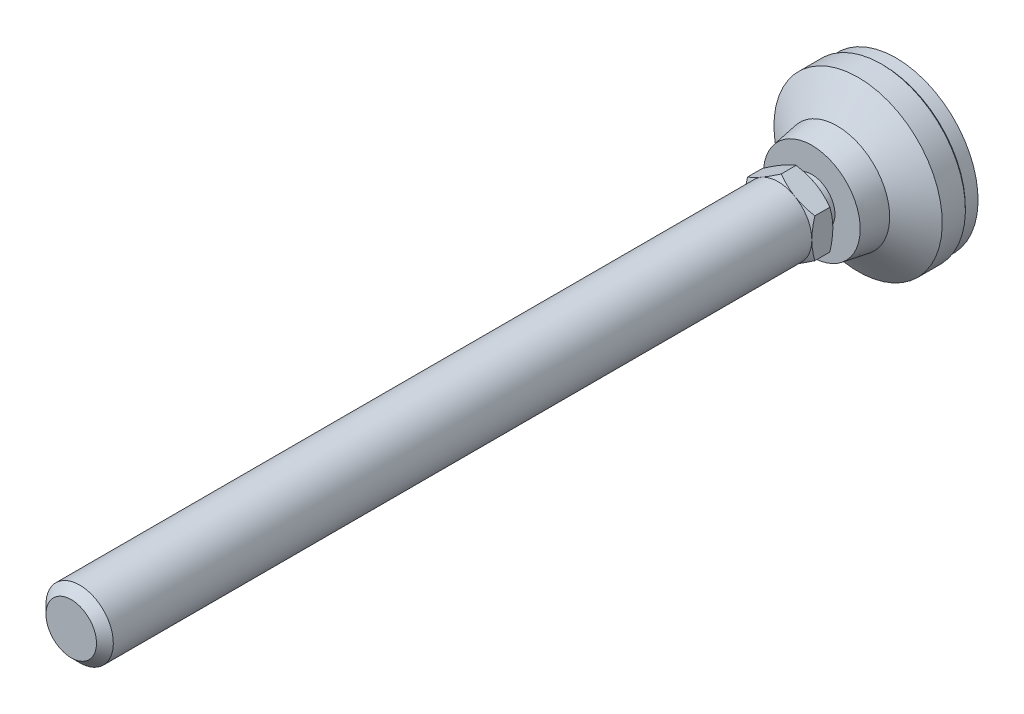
ISO-10303-21;
HEADER;
FILE_DESCRIPTION(('STEP AP214'),'2;1');
FILE_NAME('part.step','',(''),(''),'','','');
FILE_SCHEMA(('AUTOMOTIVE_DESIGN { 1 0 10303 214 1 1 1 1 }'));
ENDSEC;
DATA;
#1=APPLICATION_CONTEXT('core data for automotive mechanical design processes');
#2=APPLICATION_PROTOCOL_DEFINITION('international standard','automotive_design',2000,#1);
#3=PRODUCT_CONTEXT('',#1,'mechanical');
#4=PRODUCT('Part','Part','',(#3));
#5=PRODUCT_RELATED_PRODUCT_CATEGORY('part','',(#4));
#6=PRODUCT_DEFINITION_FORMATION('','',#4);
#7=PRODUCT_DEFINITION_CONTEXT('part definition',#1,'design');
#8=PRODUCT_DEFINITION('design','',#6,#7);
#9=PRODUCT_DEFINITION_SHAPE('','',#8);
#10=(LENGTH_UNIT() NAMED_UNIT(*) SI_UNIT(.MILLI.,.METRE.));
#11=(NAMED_UNIT(*) PLANE_ANGLE_UNIT() SI_UNIT($,.RADIAN.));
#12=(NAMED_UNIT(*) SI_UNIT($,.STERADIAN.) SOLID_ANGLE_UNIT());
#13=UNCERTAINTY_MEASURE_WITH_UNIT(LENGTH_MEASURE(1.E-05),#10,'distance_accuracy_value','');
#14=(GEOMETRIC_REPRESENTATION_CONTEXT(3) GLOBAL_UNCERTAINTY_ASSIGNED_CONTEXT((#13)) GLOBAL_UNIT_ASSIGNED_CONTEXT((#10,
#11,#12)) REPRESENTATION_CONTEXT('',''));
#15=CARTESIAN_POINT('',(0.,0.,0.));
#16=DIRECTION('',(0.,0.,1.));
#17=DIRECTION('',(1.,0.,0.));
#18=AXIS2_PLACEMENT_3D('',#15,#16,#17);
#19=CARTESIAN_POINT('',(0.,0.,2.));
#20=DIRECTION('',(0.,0.,-1.));
#21=DIRECTION('',(0.,1.,0.));
#22=AXIS2_PLACEMENT_3D('',#19,#20,#21);
#23=CYLINDRICAL_SURFACE('',#22,20.);
#24=CARTESIAN_POINT('',(0.,0.,3.5));
#25=DIRECTION('',(0.,0.,-1.));
#26=DIRECTION('',(0.,1.,0.));
#27=AXIS2_PLACEMENT_3D('',#24,#25,#26);
#28=CIRCLE('',#27,20.);
#29=CARTESIAN_POINT('',(0.,20.,3.5));
#30=VERTEX_POINT('',#29);
#31=EDGE_CURVE('E163',#30,#30,#28,.F.);
#32=ORIENTED_EDGE('',*,*,#31,.T.);
#33=EDGE_LOOP('',(#32));
#34=FACE_BOUND('',#33,.T.);
#35=CARTESIAN_POINT('',(0.,0.,9.));
#36=DIRECTION('',(0.,0.,-1.));
#37=DIRECTION('',(0.,1.,0.));
#38=AXIS2_PLACEMENT_3D('',#35,#36,#37);
#39=CIRCLE('',#38,20.);
#40=CARTESIAN_POINT('',(0.,20.,9.));
#41=VERTEX_POINT('',#40);
#42=EDGE_CURVE('E143',#41,#41,#39,.T.);
#43=ORIENTED_EDGE('',*,*,#42,.T.);
#44=EDGE_LOOP('',(#43));
#45=FACE_BOUND('',#44,.T.);
#46=ADVANCED_FACE('F14',(#34,#45),#23,.T.);
#47=CARTESIAN_POINT('',(0.,0.,2.));
#48=DIRECTION('',(0.,0.,-1.));
#49=DIRECTION('',(0.,1.,0.));
#50=AXIS2_PLACEMENT_3D('',#47,#48,#49);
#51=CYLINDRICAL_SURFACE('',#50,5.50000000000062);
#52=CARTESIAN_POINT('',(0.,0.,20.));
#53=DIRECTION('',(0.,0.,-1.));
#54=DIRECTION('',(0.,1.,0.));
#55=AXIS2_PLACEMENT_3D('',#52,#53,#54);
#56=CIRCLE('',#55,5.50000000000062);
#57=CARTESIAN_POINT('',(0.,5.50000000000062,20.));
#58=VERTEX_POINT('',#57);
#59=EDGE_CURVE('E153',#58,#58,#56,.T.);
#60=ORIENTED_EDGE('',*,*,#59,.F.);
#61=EDGE_LOOP('',(#60));
#62=FACE_BOUND('',#61,.T.);
#63=CARTESIAN_POINT('',(0.,0.,22.9999999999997));
#64=DIRECTION('',(0.,0.,-1.));
#65=DIRECTION('',(0.,1.,0.));
#66=AXIS2_PLACEMENT_3D('',#63,#64,#65);
#67=CIRCLE('',#66,5.50000000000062);
#68=CARTESIAN_POINT('',(0.,5.50000000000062,22.9999999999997));
#69=VERTEX_POINT('',#68);
#70=EDGE_CURVE('E134',#69,#69,#67,.T.);
#71=ORIENTED_EDGE('',*,*,#70,.T.);
#72=EDGE_LOOP('',(#71));
#73=FACE_BOUND('',#72,.T.);
#74=ADVANCED_FACE('F293',(#62,#73),#51,.T.);
#75=CARTESIAN_POINT('',(-11.5,0.,20.));
#76=DIRECTION('',(0.,0.,-1.));
#77=DIRECTION('',(0.,1.,0.));
#78=AXIS2_PLACEMENT_3D('',#75,#76,#77);
#79=PLANE('',#78);
#80=CARTESIAN_POINT('',(0.,0.,20.));
#81=DIRECTION('',(0.,0.,-1.));
#82=DIRECTION('',(0.,1.,0.));
#83=AXIS2_PLACEMENT_3D('',#80,#81,#82);
#84=CIRCLE('',#83,11.5);
#85=CARTESIAN_POINT('',(0.,11.5,20.));
#86=VERTEX_POINT('',#85);
#87=EDGE_CURVE('E150',#86,#86,#84,.T.);
#88=ORIENTED_EDGE('',*,*,#87,.F.);
#89=EDGE_LOOP('',(#88));
#90=FACE_BOUND('',#89,.T.);
#91=ORIENTED_EDGE('',*,*,#59,.T.);
#92=EDGE_LOOP('',(#91));
#93=FACE_BOUND('',#92,.T.);
#94=ADVANCED_FACE('F299',(#90,#93),#79,.F.);
#95=CARTESIAN_POINT('',(0.,0.,20.));
#96=DIRECTION('',(0.,0.,-1.));
#97=DIRECTION('',(0.,1.,0.));
#98=AXIS2_PLACEMENT_3D('',#95,#96,#97);
#99=CONICAL_SURFACE('',#98,11.5,0.165148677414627);
#100=CARTESIAN_POINT('',(0.,0.,14.));
#101=DIRECTION('',(0.,0.,-1.));
#102=DIRECTION('',(0.,1.,0.));
#103=AXIS2_PLACEMENT_3D('',#100,#101,#102);
#104=CIRCLE('',#103,12.5);
#105=CARTESIAN_POINT('',(0.,12.5,14.));
#106=VERTEX_POINT('',#105);
#107=EDGE_CURVE('E146',#106,#106,#104,.T.);
#108=ORIENTED_EDGE('',*,*,#107,.F.);
#109=EDGE_LOOP('',(#108));
#110=FACE_BOUND('',#109,.T.);
#111=ORIENTED_EDGE('',*,*,#87,.T.);
#112=EDGE_LOOP('',(#111));
#113=FACE_BOUND('',#112,.T.);
#114=ADVANCED_FACE('F308',(#110,#113),#99,.T.);
#115=CARTESIAN_POINT('',(0.,0.,14.));
#116=DIRECTION('',(0.,0.,-1.));
#117=DIRECTION('',(0.,1.,0.));
#118=AXIS2_PLACEMENT_3D('',#115,#116,#117);
#119=CONICAL_SURFACE('',#118,12.5,0.982793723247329);
#120=ORIENTED_EDGE('',*,*,#42,.F.);
#121=EDGE_LOOP('',(#120));
#122=FACE_BOUND('',#121,.T.);
#123=ORIENTED_EDGE('',*,*,#107,.T.);
#124=EDGE_LOOP('',(#123));
#125=FACE_BOUND('',#124,.T.);
#126=ADVANCED_FACE('F304',(#122,#125),#119,.T.);
#127=CARTESIAN_POINT('',(0.,-5.50000000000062,22.9999999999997));
#128=DIRECTION('',(0.,0.,-1.));
#129=DIRECTION('',(0.,1.,0.));
#130=AXIS2_PLACEMENT_3D('',#127,#128,#129);
#131=PLANE('',#130);
#132=CARTESIAN_POINT('',(0.,0.,22.9999999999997));
#133=DIRECTION('',(0.,0.,1.));
#134=DIRECTION('',(0.,-1.,0.));
#135=AXIS2_PLACEMENT_3D('',#132,#133,#134);
#136=CIRCLE('',#135,8.00000000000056);
#137=CARTESIAN_POINT('',(-4.,6.92820323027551,22.9999999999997));
#138=VERTEX_POINT('',#137);
#139=CARTESIAN_POINT('',(-8.,0.,22.9999999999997));
#140=VERTEX_POINT('',#139);
#141=EDGE_CURVE('E374',#138,#140,#136,.T.);
#142=ORIENTED_EDGE('',*,*,#141,.F.);
#143=CARTESIAN_POINT('',(4.,6.92820323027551,22.9999999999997));
#144=VERTEX_POINT('',#143);
#145=EDGE_CURVE('E115',#144,#138,#136,.T.);
#146=ORIENTED_EDGE('',*,*,#145,.F.);
#147=CARTESIAN_POINT('',(8.,0.,22.9999999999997));
#148=VERTEX_POINT('',#147);
#149=EDGE_CURVE('E375',#148,#144,#136,.T.);
#150=ORIENTED_EDGE('',*,*,#149,.F.);
#151=CARTESIAN_POINT('',(4.,-6.92820323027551,22.9999999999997));
#152=VERTEX_POINT('',#151);
#153=EDGE_CURVE('E35',#152,#148,#136,.T.);
#154=ORIENTED_EDGE('',*,*,#153,.F.);
#155=CARTESIAN_POINT('',(-4.,-6.92820323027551,22.9999999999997));
#156=VERTEX_POINT('',#155);
#157=EDGE_CURVE('E43',#156,#152,#136,.T.);
#158=ORIENTED_EDGE('',*,*,#157,.F.);
#159=EDGE_CURVE('E367',#140,#156,#136,.T.);
#160=ORIENTED_EDGE('',*,*,#159,.F.);
#161=EDGE_LOOP('',(#142,#146,#150,#154,#158,#160));
#162=FACE_BOUND('',#161,.T.);
#163=ORIENTED_EDGE('',*,*,#70,.F.);
#164=EDGE_LOOP('',(#163));
#165=FACE_BOUND('',#164,.T.);
#166=ADVANCED_FACE('F307',(#162,#165),#131,.T.);
#167=CARTESIAN_POINT('',(0.,0.,3.));
#168=DIRECTION('',(0.,0.,1.));
#169=DIRECTION('',(0.,-1.,0.));
#170=AXIS2_PLACEMENT_3D('',#167,#168,#169);
#171=CONICAL_SURFACE('',#170,19.5,0.785398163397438);
#172=ORIENTED_EDGE('',*,*,#31,.F.);
#173=EDGE_LOOP('',(#172));
#174=FACE_BOUND('',#173,.T.);
#175=CARTESIAN_POINT('',(0.,0.,3.));
#176=DIRECTION('',(0.,0.,-1.));
#177=DIRECTION('',(0.,1.,0.));
#178=AXIS2_PLACEMENT_3D('',#175,#176,#177);
#179=CIRCLE('',#178,19.5);
#180=CARTESIAN_POINT('',(0.,19.5,3.));
#181=VERTEX_POINT('',#180);
#182=EDGE_CURVE('E160',#181,#181,#179,.T.);
#183=ORIENTED_EDGE('',*,*,#182,.F.);
#184=EDGE_LOOP('',(#183));
#185=FACE_BOUND('',#184,.T.);
#186=ADVANCED_FACE('F16',(#174,#185),#171,.T.);
#187=CARTESIAN_POINT('',(0.,0.,0.));
#188=DIRECTION('',(0.,0.,1.));
#189=DIRECTION('',(0.,-1.,0.));
#190=AXIS2_PLACEMENT_3D('',#187,#188,#189);
#191=CYLINDRICAL_SURFACE('',#190,19.5);
#192=CARTESIAN_POINT('',(0.,0.,0.));
#193=DIRECTION('',(0.,0.,-1.));
#194=DIRECTION('',(0.,1.,0.));
#195=AXIS2_PLACEMENT_3D('',#192,#193,#194);
#196=CIRCLE('',#195,19.5);
#197=CARTESIAN_POINT('',(0.,19.5,0.));
#198=VERTEX_POINT('',#197);
#199=EDGE_CURVE('E406',#198,#198,#196,.T.);
#200=ORIENTED_EDGE('',*,*,#199,.F.);
#201=EDGE_LOOP('',(#200));
#202=FACE_BOUND('',#201,.T.);
#203=ORIENTED_EDGE('',*,*,#182,.T.);
#204=EDGE_LOOP('',(#203));
#205=FACE_BOUND('',#204,.T.);
#206=ADVANCED_FACE('F335',(#202,#205),#191,.T.);
#207=CARTESIAN_POINT('',(0.,0.,0.));
#208=DIRECTION('',(0.,0.,-1.));
#209=DIRECTION('',(0.,1.,0.));
#210=AXIS2_PLACEMENT_3D('',#207,#208,#209);
#211=PLANE('',#210);
#212=ORIENTED_EDGE('',*,*,#199,.T.);
#213=EDGE_LOOP('',(#212));
#214=FACE_BOUND('',#213,.T.);
#215=ADVANCED_FACE('F183',(#214),#211,.T.);
#216=CARTESIAN_POINT('',(0.,0.,22.9999999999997));
#217=DIRECTION('',(0.,0.,1.));
#218=DIRECTION('',(0.,-1.,0.));
#219=AXIS2_PLACEMENT_3D('',#216,#217,#218);
#220=CONICAL_SURFACE('',#219,8.00000000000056,1.0471975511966);
#221=CARTESIAN_POINT('',(-0.000199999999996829,9.23771977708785,23.7145978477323));
#222=CARTESIAN_POINT('',(0.1756487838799,9.13619343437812,23.6559907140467));
#223=CARTESIAN_POINT('',(0.352153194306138,9.03428856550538,23.6000434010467));
#224=CARTESIAN_POINT('',(0.706595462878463,8.82965122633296,23.494201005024));
#225=CARTESIAN_POINT('',(0.884533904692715,8.72691841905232,23.4443085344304));
#226=CARTESIAN_POINT('',(1.42119823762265,8.41707512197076,23.3046927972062));
#227=CARTESIAN_POINT('',(1.78204258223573,8.20874154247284,23.2252811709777));
#228=CARTESIAN_POINT('',(2.32203917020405,7.89697436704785,23.1321616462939));
#229=CARTESIAN_POINT('',(2.49957818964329,7.79447216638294,23.1056345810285));
#230=CARTESIAN_POINT('',(2.8554591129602,7.58900421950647,23.0611531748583));
#231=CARTESIAN_POINT('',(3.03380094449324,7.4860385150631,23.043198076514));
#232=CARTESIAN_POINT('',(3.3907916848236,7.27992981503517,23.0163156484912));
#233=CARTESIAN_POINT('',(3.5694400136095,7.17678715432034,23.0073780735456));
#234=CARTESIAN_POINT('',(3.92690170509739,6.97040655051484,22.9987223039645));
#235=CARTESIAN_POINT('',(4.10571506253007,6.86716861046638,22.9990038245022));
#236=CARTESIAN_POINT('',(4.44001336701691,6.67416139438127,23.0081450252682));
#237=CARTESIAN_POINT('',(4.59552190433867,6.58437849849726,23.0158896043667));
#238=CARTESIAN_POINT('',(4.90617476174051,6.40502298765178,23.0382011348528));
#239=CARTESIAN_POINT('',(5.06131905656,6.31545038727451,23.0527685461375));
#240=CARTESIAN_POINT('',(5.52615131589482,6.04707935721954,23.1063606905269));
#241=CARTESIAN_POINT('',(5.83501648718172,5.86875596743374,23.1552686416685));
#242=CARTESIAN_POINT('',(6.4560232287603,5.51021755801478,23.2775394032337));
#243=CARTESIAN_POINT('',(6.76808554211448,5.3300482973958,23.3514205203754));
#244=CARTESIAN_POINT('',(7.38755648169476,4.97239658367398,23.5191001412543));
#245=CARTESIAN_POINT('',(7.69497304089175,4.79490955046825,23.6128592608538));
#246=CARTESIAN_POINT('',(8.0002,4.61868668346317,23.7145978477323));
#247=B_SPLINE_CURVE_WITH_KNOTS('',3,(#221,#222,#223,#224,#225,#226,#227,#228,#229,#230,#231,
#232,#233,#234,#235,#236,#237,#238,#239,#240,#241,#242,#243,#244,#245,#246),.UNSPECIFIED.,.F.,
.F.,(4,2,2,2,2,2,2,2,2,2,2,2,4),(0.,0.63397354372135,1.26821965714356,2.53934712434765,
3.15934343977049,3.77928496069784,4.39852133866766,5.01773858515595,5.55680239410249,
6.09590254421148,7.17487077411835,8.27776850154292,9.37850115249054),.UNSPECIFIED.);
#248=CARTESIAN_POINT('',(0.,9.23760430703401,23.7145311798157));
#249=VERTEX_POINT('',#248);
#250=EDGE_CURVE('E112',#249,#144,#247,.T.);
#251=ORIENTED_EDGE('',*,*,#250,.T.);
#252=ORIENTED_EDGE('',*,*,#145,.T.);
#253=CARTESIAN_POINT('',(-8.0002,4.61868668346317,23.7145978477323));
#254=CARTESIAN_POINT('',(-7.8243512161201,4.7202130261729,23.6559907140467));
#255=CARTESIAN_POINT('',(-7.64784680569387,4.82211789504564,23.6000434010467));
#256=CARTESIAN_POINT('',(-7.29340453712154,5.02675523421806,23.494201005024));
#257=CARTESIAN_POINT('',(-7.11546609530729,5.1294880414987,23.4443085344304));
#258=CARTESIAN_POINT('',(-6.57880176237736,5.43933133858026,23.3046927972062));
#259=CARTESIAN_POINT('',(-6.21795741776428,5.64766491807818,23.2252811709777));
#260=CARTESIAN_POINT('',(-5.67796082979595,5.95943209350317,23.1321616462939));
#261=CARTESIAN_POINT('',(-5.50042181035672,6.06193429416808,23.1056345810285));
#262=CARTESIAN_POINT('',(-5.1445408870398,6.26740224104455,23.0611531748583));
#263=CARTESIAN_POINT('',(-4.96619905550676,6.37036794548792,23.043198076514));
#264=CARTESIAN_POINT('',(-4.60920831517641,6.57647664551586,23.0163156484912));
#265=CARTESIAN_POINT('',(-4.4305599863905,6.67961930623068,23.0073780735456));
#266=CARTESIAN_POINT('',(-4.07309829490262,6.88599991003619,22.9987223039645));
#267=CARTESIAN_POINT('',(-3.89428493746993,6.98923785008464,22.9990038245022));
#268=CARTESIAN_POINT('',(-3.55998663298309,7.18224506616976,23.0081450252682));
#269=CARTESIAN_POINT('',(-3.40447809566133,7.27202796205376,23.0158896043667));
#270=CARTESIAN_POINT('',(-3.09382523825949,7.45138347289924,23.0382011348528));
#271=CARTESIAN_POINT('',(-2.93868094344,7.54095607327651,23.0527685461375));
#272=CARTESIAN_POINT('',(-2.47384868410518,7.80932710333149,23.1063606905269));
#273=CARTESIAN_POINT('',(-2.16498351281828,7.98765049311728,23.1552686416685));
#274=CARTESIAN_POINT('',(-1.5439767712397,8.34618890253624,23.2775394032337));
#275=CARTESIAN_POINT('',(-1.23191445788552,8.52635816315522,23.3514205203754));
#276=CARTESIAN_POINT('',(-0.612443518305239,8.88400987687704,23.5191001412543));
#277=CARTESIAN_POINT('',(-0.305026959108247,9.06149691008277,23.6128592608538));
#278=CARTESIAN_POINT('',(0.000200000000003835,9.23771977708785,23.7145978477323));
#279=B_SPLINE_CURVE_WITH_KNOTS('',3,(#253,#254,#255,#256,#257,#258,#259,#260,#261,#262,#263,
#264,#265,#266,#267,#268,#269,#270,#271,#272,#273,#274,#275,#276,#277,#278),.UNSPECIFIED.,.F.,
.F.,(4,2,2,2,2,2,2,2,2,2,2,2,4),(0.,0.63397354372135,1.26821965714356,2.53934712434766,
3.15934343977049,3.77928496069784,4.39852133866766,5.01773858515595,5.55680239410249,
6.09590254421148,7.17487077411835,8.27776850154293,9.37850115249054),.UNSPECIFIED.);
#280=EDGE_CURVE('E18',#138,#249,#279,.T.);
#281=ORIENTED_EDGE('',*,*,#280,.T.);
#282=EDGE_LOOP('',(#251,#252,#281));
#283=FACE_BOUND('',#282,.T.);
#284=ADVANCED_FACE('F111',(#283),#220,.T.);
#285=CARTESIAN_POINT('',(-8.,12.3990254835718,26.9005059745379));
#286=CARTESIAN_POINT('',(-8.,12.049683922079,26.7310747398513));
#287=CARTESIAN_POINT('',(-8.,11.6995396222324,26.5632702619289));
#288=CARTESIAN_POINT('',(-8.,10.9972186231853,26.2318298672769));
#289=CARTESIAN_POINT('',(-8.,10.6450416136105,26.0681946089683));
#290=CARTESIAN_POINT('',(-8.,9.93641002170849,25.7451827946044));
#291=CARTESIAN_POINT('',(-8.,9.5799425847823,25.5858343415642));
#292=CARTESIAN_POINT('',(-8.,8.86416996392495,25.2736684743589));
#293=CARTESIAN_POINT('',(-8.,8.50486491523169,25.1208507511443));
#294=CARTESIAN_POINT('',(-8.,7.77126229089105,24.8187000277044));
#295=CARTESIAN_POINT('',(-8.,7.39685337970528,24.669635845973));
#296=CARTESIAN_POINT('',(-8.,6.64365326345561,24.3828076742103));
#297=CARTESIAN_POINT('',(-8.,6.26486157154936,24.2450449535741));
#298=CARTESIAN_POINT('',(-8.,5.50300019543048,23.9844423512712));
#299=CARTESIAN_POINT('',(-8.,5.11994098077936,23.8615721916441));
#300=CARTESIAN_POINT('',(-8.,4.34834145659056,23.6347009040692));
#301=CARTESIAN_POINT('',(-8.,3.95980291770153,23.5306938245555));
#302=CARTESIAN_POINT('',(-8.,3.17912277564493,23.3471068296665));
#303=CARTESIAN_POINT('',(-8.,2.7870132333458,23.2673942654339));
#304=CARTESIAN_POINT('',(-8.,2.19528425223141,23.1694992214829));
#305=CARTESIAN_POINT('',(-8.,1.99743252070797,23.1404785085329));
#306=CARTESIAN_POINT('',(-8.,1.60074822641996,23.0902310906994));
#307=CARTESIAN_POINT('',(-8.,1.40191576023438,23.0690036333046));
#308=CARTESIAN_POINT('',(-8.,1.00613017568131,23.0350314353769));
#309=CARTESIAN_POINT('',(-8.,0.809186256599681,23.0221799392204));
#310=CARTESIAN_POINT('',(-8.,0.414931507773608,23.0048162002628));
#311=CARTESIAN_POINT('',(-8.,0.217620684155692,23.0003038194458));
#312=CARTESIAN_POINT('',(-8.,-0.177015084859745,22.9997259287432));
#313=CARTESIAN_POINT('',(-8.,-0.374340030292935,23.0036604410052));
#314=CARTESIAN_POINT('',(-8.,-0.768648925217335,23.0198803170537));
#315=CARTESIAN_POINT('',(-8.,-0.965632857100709,23.0321660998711));
#316=CARTESIAN_POINT('',(-8.,-1.43928823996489,23.0714887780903));
#317=CARTESIAN_POINT('',(-8.,-1.71563654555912,23.1025015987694));
#318=CARTESIAN_POINT('',(-8.,-2.26626398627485,23.1792696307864));
#319=CARTESIAN_POINT('',(-8.,-2.54054283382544,23.2250268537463));
#320=CARTESIAN_POINT('',(-8.,-3.35997272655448,23.3819872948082));
#321=CARTESIAN_POINT('',(-8.,-3.90140681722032,23.512850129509));
#322=CARTESIAN_POINT('',(-8.,-4.71095852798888,23.7395480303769));
#323=CARTESIAN_POINT('',(-8.,-4.98328146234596,23.8212275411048));
#324=CARTESIAN_POINT('',(-8.,-5.52528209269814,23.9930142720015));
#325=CARTESIAN_POINT('',(-8.,-5.79495977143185,24.0831215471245));
#326=CARTESIAN_POINT('',(-8.,-6.33175551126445,24.2703227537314));
#327=CARTESIAN_POINT('',(-8.,-6.59887439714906,24.3674143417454));
#328=CARTESIAN_POINT('',(-8.,-7.13090307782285,24.567447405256));
#329=CARTESIAN_POINT('',(-8.,-7.39581289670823,24.6703888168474));
#330=CARTESIAN_POINT('',(-8.,-8.0135494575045,24.9170369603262));
#331=CARTESIAN_POINT('',(-8.,-8.36559791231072,25.0626891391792));
#332=CARTESIAN_POINT('',(-8.,-9.06675398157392,25.3609277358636));
#333=CARTESIAN_POINT('',(-8.,-9.41586142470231,25.5135145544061));
#334=CARTESIAN_POINT('',(-8.,-10.1116727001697,25.8242552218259));
#335=CARTESIAN_POINT('',(-8.,-10.4583760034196,25.9824102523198));
#336=CARTESIAN_POINT('',(-8.,-11.149698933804,26.3031820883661));
#337=CARTESIAN_POINT('',(-8.,-11.4943186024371,26.4657988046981));
#338=CARTESIAN_POINT('',(-8.,-12.1821776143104,26.7948439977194));
#339=CARTESIAN_POINT('',(-8.,-12.5254151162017,26.9612763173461));
#340=CARTESIAN_POINT('',(-8.,-13.2104170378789,27.2971480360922));
#341=CARTESIAN_POINT('',(-8.,-13.552181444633,27.4665874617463));
#342=CARTESIAN_POINT('',(-8.,-14.5755246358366,27.9785839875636));
#343=CARTESIAN_POINT('',(-8.,-15.2552416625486,28.3248619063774));
#344=CARTESIAN_POINT('',(-8.,-16.5553497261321,28.9956871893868));
#345=CARTESIAN_POINT('',(-8.,-17.1760268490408,29.319682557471));
#346=CARTESIAN_POINT('',(-8.,-18.4150545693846,29.9721389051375));
#347=CARTESIAN_POINT('',(-8.,-19.0334050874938,30.3006000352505));
#348=CARTESIAN_POINT('',(-8.,-20.2667857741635,30.9601289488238));
#349=CARTESIAN_POINT('',(-8.,-20.8818203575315,31.2911884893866));
#350=CARTESIAN_POINT('',(-8.,-22.1103972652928,31.9559875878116));
#351=CARTESIAN_POINT('',(-8.,-22.7239396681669,32.2897270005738));
#352=CARTESIAN_POINT('',(-8.,-23.3369307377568,32.6244691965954));
#353=B_SPLINE_CURVE_WITH_KNOTS('',3,(#285,#286,#287,#288,#289,#290,#291,#292,#293,#294,#295,
#296,#297,#298,#299,#300,#301,#302,#303,#304,#305,#306,#307,#308,#309,#310,#311,#312,#313,#314,
#315,#316,#317,#318,#319,#320,#321,#322,#323,#324,#325,#326,#327,#328,#329,#330,#331,#332,#333,
#334,#335,#336,#337,#338,#339,#340,#341,#342,#343,#344,#345,#346,#347,#348,#349,#350,#351,#352),
.UNSPECIFIED.,.F.,.F.,(4,2,2,2,2,2,2,2,2,2,2,2,2,2,2,2,2,2,2,2,2,2,2,2,2,2,2,2,2,2,2,2,2,4),(0.,
1.16479673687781,2.32977629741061,3.50111130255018,4.67239081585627,5.88122380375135,
7.09019238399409,8.29666025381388,9.50274680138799,10.7021249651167,11.3019019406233,
11.9016209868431,12.4935385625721,13.0854463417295,13.677355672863,14.2692947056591,
15.1030724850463,15.9369640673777,17.6056780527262,18.4585330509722,19.3113936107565,
20.1639693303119,21.0165357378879,22.159403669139,23.3023377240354,24.4455157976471,
25.5886710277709,26.7330331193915,27.8774053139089,30.165855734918,32.2662928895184,
34.3668010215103,36.4622203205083,38.5575269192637),.UNSPECIFIED.);
#354=CARTESIAN_POINT('',(-8.,4.61880215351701,23.7145311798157));
#355=VERTEX_POINT('',#354);
#356=EDGE_CURVE('E347',#140,#355,#353,.F.);
#357=ORIENTED_EDGE('',*,*,#356,.T.);
#358=EDGE_CURVE('E9',#355,#138,#279,.T.);
#359=ORIENTED_EDGE('',*,*,#358,.T.);
#360=ORIENTED_EDGE('',*,*,#141,.T.);
#361=EDGE_LOOP('',(#357,#359,#360));
#362=FACE_BOUND('',#361,.T.);
#363=ADVANCED_FACE('F181',(#362),#220,.T.);
#364=CARTESIAN_POINT('',(0.000200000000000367,-9.23771977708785,23.7145978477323));
#365=CARTESIAN_POINT('',(-0.175648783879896,-9.13619343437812,23.6559907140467));
#366=CARTESIAN_POINT('',(-0.352153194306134,-9.03428856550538,23.6000434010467));
#367=CARTESIAN_POINT('',(-0.70659546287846,-8.82965122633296,23.494201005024));
#368=CARTESIAN_POINT('',(-0.884533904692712,-8.72691841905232,23.4443085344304));
#369=CARTESIAN_POINT('',(-1.42119823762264,-8.41707512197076,23.3046927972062));
#370=CARTESIAN_POINT('',(-1.78204258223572,-8.20874154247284,23.2252811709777));
#371=CARTESIAN_POINT('',(-2.32203917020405,-7.89697436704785,23.1321616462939));
#372=CARTESIAN_POINT('',(-2.49957818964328,-7.79447216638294,23.1056345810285));
#373=CARTESIAN_POINT('',(-2.8554591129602,-7.58900421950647,23.0611531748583));
#374=CARTESIAN_POINT('',(-3.03380094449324,-7.4860385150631,23.043198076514));
#375=CARTESIAN_POINT('',(-3.39079168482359,-7.27992981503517,23.0163156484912));
#376=CARTESIAN_POINT('',(-3.5694400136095,-7.17678715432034,23.0073780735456));
#377=CARTESIAN_POINT('',(-3.92690170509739,-6.97040655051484,22.9987223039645));
#378=CARTESIAN_POINT('',(-4.10571506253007,-6.86716861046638,22.9990038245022));
#379=CARTESIAN_POINT('',(-4.44001336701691,-6.67416139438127,23.0081450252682));
#380=CARTESIAN_POINT('',(-4.59552190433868,-6.58437849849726,23.0158896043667));
#381=CARTESIAN_POINT('',(-4.90617476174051,-6.40502298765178,23.0382011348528));
#382=CARTESIAN_POINT('',(-5.06131905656,-6.31545038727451,23.0527685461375));
#383=CARTESIAN_POINT('',(-5.52615131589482,-6.04707935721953,23.1063606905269));
#384=CARTESIAN_POINT('',(-5.83501648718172,-5.86875596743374,23.1552686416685));
#385=CARTESIAN_POINT('',(-6.4560232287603,-5.51021755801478,23.2775394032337));
#386=CARTESIAN_POINT('',(-6.76808554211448,-5.3300482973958,23.3514205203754));
#387=CARTESIAN_POINT('',(-7.38755648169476,-4.97239658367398,23.5191001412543));
#388=CARTESIAN_POINT('',(-7.69497304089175,-4.79490955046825,23.6128592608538));
#389=CARTESIAN_POINT('',(-8.0002,-4.61868668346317,23.7145978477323));
#390=B_SPLINE_CURVE_WITH_KNOTS('',3,(#364,#365,#366,#367,#368,#369,#370,#371,#372,#373,#374,
#375,#376,#377,#378,#379,#380,#381,#382,#383,#384,#385,#386,#387,#388,#389),.UNSPECIFIED.,.F.,
.F.,(4,2,2,2,2,2,2,2,2,2,2,2,4),(0.,0.63397354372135,1.26821965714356,2.53934712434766,
3.15934343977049,3.77928496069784,4.39852133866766,5.01773858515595,5.55680239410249,
6.09590254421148,7.17487077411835,8.27776850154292,9.37850115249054),.UNSPECIFIED.);
#391=CARTESIAN_POINT('',(-8.,-4.618802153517,23.7145311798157));
#392=VERTEX_POINT('',#391);
#393=EDGE_CURVE('E354',#156,#392,#390,.T.);
#394=ORIENTED_EDGE('',*,*,#393,.T.);
#395=EDGE_CURVE('E353',#392,#140,#353,.F.);
#396=ORIENTED_EDGE('',*,*,#395,.T.);
#397=ORIENTED_EDGE('',*,*,#159,.T.);
#398=EDGE_LOOP('',(#394,#396,#397));
#399=FACE_BOUND('',#398,.T.);
#400=ADVANCED_FACE('F365',(#399),#220,.T.);
#401=CARTESIAN_POINT('',(8.0002,-4.61868668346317,23.7145978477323));
#402=CARTESIAN_POINT('',(7.8243512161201,-4.7202130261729,23.6559907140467));
#403=CARTESIAN_POINT('',(7.64784680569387,-4.82211789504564,23.6000434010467));
#404=CARTESIAN_POINT('',(7.29340453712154,-5.02675523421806,23.494201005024));
#405=CARTESIAN_POINT('',(7.11546609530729,-5.1294880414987,23.4443085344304));
#406=CARTESIAN_POINT('',(6.57880176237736,-5.43933133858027,23.3046927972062));
#407=CARTESIAN_POINT('',(6.21795741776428,-5.64766491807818,23.2252811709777));
#408=CARTESIAN_POINT('',(5.67796082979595,-5.95943209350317,23.1321616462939));
#409=CARTESIAN_POINT('',(5.50042181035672,-6.06193429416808,23.1056345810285));
#410=CARTESIAN_POINT('',(5.1445408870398,-6.26740224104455,23.0611531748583));
#411=CARTESIAN_POINT('',(4.96619905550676,-6.37036794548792,23.043198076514));
#412=CARTESIAN_POINT('',(4.60920831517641,-6.57647664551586,23.0163156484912));
#413=CARTESIAN_POINT('',(4.4305599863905,-6.67961930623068,23.0073780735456));
#414=CARTESIAN_POINT('',(4.07309829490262,-6.88599991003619,22.9987223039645));
#415=CARTESIAN_POINT('',(3.89428493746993,-6.98923785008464,22.9990038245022));
#416=CARTESIAN_POINT('',(3.55998663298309,-7.18224506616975,23.0081450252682));
#417=CARTESIAN_POINT('',(3.40447809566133,-7.27202796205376,23.0158896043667));
#418=CARTESIAN_POINT('',(3.09382523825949,-7.45138347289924,23.0382011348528));
#419=CARTESIAN_POINT('',(2.93868094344,-7.54095607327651,23.0527685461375));
#420=CARTESIAN_POINT('',(2.47384868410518,-7.80932710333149,23.1063606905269));
#421=CARTESIAN_POINT('',(2.16498351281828,-7.98765049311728,23.1552686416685));
#422=CARTESIAN_POINT('',(1.5439767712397,-8.34618890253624,23.2775394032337));
#423=CARTESIAN_POINT('',(1.23191445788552,-8.52635816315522,23.3514205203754));
#424=CARTESIAN_POINT('',(0.612443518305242,-8.88400987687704,23.5191001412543));
#425=CARTESIAN_POINT('',(0.30502695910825,-9.06149691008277,23.6128592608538));
#426=CARTESIAN_POINT('',(-0.000200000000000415,-9.23771977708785,23.7145978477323));
#427=B_SPLINE_CURVE_WITH_KNOTS('',3,(#401,#402,#403,#404,#405,#406,#407,#408,#409,#410,#411,
#412,#413,#414,#415,#416,#417,#418,#419,#420,#421,#422,#423,#424,#425,#426),.UNSPECIFIED.,.F.,
.F.,(4,2,2,2,2,2,2,2,2,2,2,2,4),(0.,0.633973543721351,1.26821965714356,2.53934712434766,
3.15934343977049,3.77928496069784,4.39852133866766,5.01773858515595,5.55680239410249,
6.09590254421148,7.17487077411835,8.27776850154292,9.37850115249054),.UNSPECIFIED.);
#428=CARTESIAN_POINT('',(0.,-9.23760430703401,23.7145311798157));
#429=VERTEX_POINT('',#428);
#430=EDGE_CURVE('E244',#152,#429,#427,.T.);
#431=ORIENTED_EDGE('',*,*,#430,.T.);
#432=EDGE_CURVE('E359',#429,#156,#390,.T.);
#433=ORIENTED_EDGE('',*,*,#432,.T.);
#434=ORIENTED_EDGE('',*,*,#157,.T.);
#435=EDGE_LOOP('',(#431,#433,#434));
#436=FACE_BOUND('',#435,.T.);
#437=ADVANCED_FACE('F390',(#436),#220,.T.);
#438=CARTESIAN_POINT('',(8.,12.3990254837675,26.9005059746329));
#439=CARTESIAN_POINT('',(8.,12.0496839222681,26.7310747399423));
#440=CARTESIAN_POINT('',(8.,11.6995396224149,26.5632702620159));
#441=CARTESIAN_POINT('',(8.,10.9972186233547,26.2318298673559));
#442=CARTESIAN_POINT('',(8.,10.6450416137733,26.0681946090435));
#443=CARTESIAN_POINT('',(8.,9.93641002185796,25.7451827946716));
#444=CARTESIAN_POINT('',(8.,9.57994258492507,25.5858343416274));
#445=CARTESIAN_POINT('',(8.,8.86416996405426,25.2736684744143));
#446=CARTESIAN_POINT('',(8.,8.50486491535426,25.1208507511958));
#447=CARTESIAN_POINT('',(8.,7.77126229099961,24.8187000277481));
#448=CARTESIAN_POINT('',(8.,7.39685337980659,24.6696358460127));
#449=CARTESIAN_POINT('',(8.,6.6436532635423,24.3828076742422));
#450=CARTESIAN_POINT('',(8.,6.26486157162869,24.2450449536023));
#451=CARTESIAN_POINT('',(8.,5.50300019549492,23.9844423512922));
#452=CARTESIAN_POINT('',(8.,5.11994098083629,23.8615721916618));
#453=CARTESIAN_POINT('',(8.,4.34834145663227,23.6347009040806));
#454=CARTESIAN_POINT('',(8.,3.95980291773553,23.5306938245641));
#455=CARTESIAN_POINT('',(8.,3.17912277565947,23.3471068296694));
#456=CARTESIAN_POINT('',(8.,2.78701323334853,23.2673942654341));
#457=CARTESIAN_POINT('',(8.,2.19528425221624,23.1694992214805));
#458=CARTESIAN_POINT('',(8.,1.99743252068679,23.1404785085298));
#459=CARTESIAN_POINT('',(8.,1.60074822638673,23.0902310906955));
#460=CARTESIAN_POINT('',(8.,1.40191576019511,23.0690036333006));
#461=CARTESIAN_POINT('',(8.,1.00613017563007,23.0350314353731));
#462=CARTESIAN_POINT('',(8.,0.809186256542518,23.022179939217));
#463=CARTESIAN_POINT('',(8.,0.414931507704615,23.0048162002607));
#464=CARTESIAN_POINT('',(8.,0.21762068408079,23.0003038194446));
#465=CARTESIAN_POINT('',(8.,-0.177015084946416,22.9997259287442));
#466=CARTESIAN_POINT('',(8.,-0.374340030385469,23.0036604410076));
#467=CARTESIAN_POINT('',(8.,-0.768648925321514,23.0198803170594));
#468=CARTESIAN_POINT('',(8.,-0.965632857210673,23.0321660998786));
#469=CARTESIAN_POINT('',(8.,-1.43928824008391,23.0714887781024));
#470=CARTESIAN_POINT('',(8.,-1.71563654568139,23.1025015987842));
#471=CARTESIAN_POINT('',(8.,-2.26626398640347,23.1792696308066));
#472=CARTESIAN_POINT('',(8.,-2.54054283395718,23.2250268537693));
#473=CARTESIAN_POINT('',(8.,-3.35997272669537,23.3819872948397));
#474=CARTESIAN_POINT('',(8.,-3.90140681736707,23.5128501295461));
#475=CARTESIAN_POINT('',(8.,-4.71095852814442,23.7395480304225));
#476=CARTESIAN_POINT('',(8.,-4.98328146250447,23.8212275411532));
#477=CARTESIAN_POINT('',(8.,-5.52528209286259,23.9930142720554));
#478=CARTESIAN_POINT('',(8.,-5.79495977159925,24.0831215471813));
#479=CARTESIAN_POINT('',(8.,-6.33175551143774,24.2703227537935));
#480=CARTESIAN_POINT('',(8.,-6.59887439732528,24.3674143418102));
#481=CARTESIAN_POINT('',(8.,-7.13090307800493,24.5674474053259));
#482=CARTESIAN_POINT('',(8.,-7.39581289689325,24.6703888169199));
#483=CARTESIAN_POINT('',(8.,-8.01354945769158,24.9170369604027));
#484=CARTESIAN_POINT('',(8.,-8.36559791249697,25.0626891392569));
#485=CARTESIAN_POINT('',(8.,-9.06675398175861,25.3609277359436));
#486=CARTESIAN_POINT('',(8.,-9.41586142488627,25.5135145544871));
#487=CARTESIAN_POINT('',(8.,-10.1116727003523,25.8242552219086));
#488=CARTESIAN_POINT('',(8.,-10.4583760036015,25.9824102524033));
#489=CARTESIAN_POINT('',(8.,-11.1496989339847,26.3031820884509));
#490=CARTESIAN_POINT('',(8.,-11.4943186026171,26.4657988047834));
#491=CARTESIAN_POINT('',(8.,-12.1821776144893,26.7948439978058));
#492=CARTESIAN_POINT('',(8.,-12.52541511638,26.9612763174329));
#493=CARTESIAN_POINT('',(8.,-13.2104170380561,27.2971480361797));
#494=CARTESIAN_POINT('',(8.,-13.5521814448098,27.4665874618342));
#495=CARTESIAN_POINT('',(8.,-14.5755246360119,27.9785839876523));
#496=CARTESIAN_POINT('',(8.,-15.2552416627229,28.3248619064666));
#497=CARTESIAN_POINT('',(8.,-16.5553497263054,28.9956871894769));
#498=CARTESIAN_POINT('',(8.,-17.1760268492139,29.3196825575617));
#499=CARTESIAN_POINT('',(8.,-18.4150545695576,29.9721389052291));
#500=CARTESIAN_POINT('',(7.99999999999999,-19.0334050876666,30.3006000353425));
#501=CARTESIAN_POINT('',(7.99999999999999,-20.2667857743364,30.9601289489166));
#502=CARTESIAN_POINT('',(7.99999999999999,-20.8818203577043,31.2911884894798));
#503=CARTESIAN_POINT('',(7.99999999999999,-22.1103972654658,31.9559875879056));
#504=CARTESIAN_POINT('',(8.,-22.72393966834,32.2897270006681));
#505=CARTESIAN_POINT('',(8.,-23.33693073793,32.62446919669));
#506=B_SPLINE_CURVE_WITH_KNOTS('',3,(#438,#439,#440,#441,#442,#443,#444,#445,#446,#447,#448,
#449,#450,#451,#452,#453,#454,#455,#456,#457,#458,#459,#460,#461,#462,#463,#464,#465,#466,#467,
#468,#469,#470,#471,#472,#473,#474,#475,#476,#477,#478,#479,#480,#481,#482,#483,#484,#485,#486,
#487,#488,#489,#490,#491,#492,#493,#494,#495,#496,#497,#498,#499,#500,#501,#502,#503,#504,#505),
.UNSPECIFIED.,.F.,.F.,(4,2,2,2,2,2,2,2,2,2,2,2,2,2,2,2,2,2,2,2,2,2,2,2,2,2,2,2,2,2,2,2,2,4),(0.,
1.16479673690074,2.3297762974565,3.50111130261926,4.67239081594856,5.88122380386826,
7.09019238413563,8.29666025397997,9.50274680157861,10.7021249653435,11.3019019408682,
11.901620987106,12.4935385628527,13.0854463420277,13.6773556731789,14.2692947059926,
15.1030724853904,15.9369640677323,17.6056780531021,18.458533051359,19.3113936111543,
20.1639693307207,21.0165357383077,22.159403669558,23.3023377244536,24.4455157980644,
25.5886710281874,26.7330331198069,27.8774053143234,30.1658557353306,32.2662928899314,
34.3668010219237,36.4622203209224,38.5575269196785),.UNSPECIFIED.);
#507=CARTESIAN_POINT('',(8.,-4.61880215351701,23.7145311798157));
#508=VERTEX_POINT('',#507);
#509=EDGE_CURVE('E236',#148,#508,#506,.T.);
#510=ORIENTED_EDGE('',*,*,#509,.T.);
#511=EDGE_CURVE('E243',#508,#152,#427,.T.);
#512=ORIENTED_EDGE('',*,*,#511,.T.);
#513=ORIENTED_EDGE('',*,*,#153,.T.);
#514=EDGE_LOOP('',(#510,#512,#513));
#515=FACE_BOUND('',#514,.T.);
#516=ADVANCED_FACE('F384',(#515),#220,.T.);
#517=CARTESIAN_POINT('',(8.,4.61880215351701,23.7145311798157));
#518=VERTEX_POINT('',#517);
#519=EDGE_CURVE('E127',#144,#518,#247,.T.);
#520=ORIENTED_EDGE('',*,*,#519,.T.);
#521=EDGE_CURVE('E242',#518,#148,#506,.T.);
#522=ORIENTED_EDGE('',*,*,#521,.T.);
#523=ORIENTED_EDGE('',*,*,#149,.T.);
#524=EDGE_LOOP('',(#520,#522,#523));
#525=FACE_BOUND('',#524,.T.);
#526=ADVANCED_FACE('F330',(#525),#220,.T.);
#527=CARTESIAN_POINT('',(0.,0.,196.));
#528=DIRECTION('',(0.,0.,-1.));
#529=DIRECTION('',(0.,1.,0.));
#530=AXIS2_PLACEMENT_3D('',#527,#528,#529);
#531=PLANE('',#530);
#532=CARTESIAN_POINT('',(0.,0.,196.));
#533=DIRECTION('',(0.,0.,-1.));
#534=DIRECTION('',(0.,1.,0.));
#535=AXIS2_PLACEMENT_3D('',#532,#533,#534);
#536=CIRCLE('',#535,6.00000000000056);
#537=CARTESIAN_POINT('',(0.,6.00000000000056,196.));
#538=VERTEX_POINT('',#537);
#539=EDGE_CURVE('E139',#538,#538,#536,.T.);
#540=ORIENTED_EDGE('',*,*,#539,.F.);
#541=EDGE_LOOP('',(#540));
#542=FACE_BOUND('',#541,.T.);
#543=ADVANCED_FACE('F323',(#542),#531,.F.);
#544=CARTESIAN_POINT('',(0.,0.,196.));
#545=DIRECTION('',(0.,0.,-1.));
#546=DIRECTION('',(0.,1.,0.));
#547=AXIS2_PLACEMENT_3D('',#544,#545,#546);
#548=CONICAL_SURFACE('',#547,6.00000000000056,0.785398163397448);
#549=CARTESIAN_POINT('',(0.,0.,194.));
#550=DIRECTION('',(0.,0.,-1.));
#551=DIRECTION('',(0.,1.,0.));
#552=AXIS2_PLACEMENT_3D('',#549,#550,#551);
#553=CIRCLE('',#552,8.00000000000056);
#554=CARTESIAN_POINT('',(0.,8.00000000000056,194.));
#555=VERTEX_POINT('',#554);
#556=EDGE_CURVE('E404',#555,#555,#553,.T.);
#557=ORIENTED_EDGE('',*,*,#556,.F.);
#558=EDGE_LOOP('',(#557));
#559=FACE_BOUND('',#558,.T.);
#560=ORIENTED_EDGE('',*,*,#539,.T.);
#561=EDGE_LOOP('',(#560));
#562=FACE_BOUND('',#561,.T.);
#563=ADVANCED_FACE('F316',(#559,#562),#548,.T.);
#564=CARTESIAN_POINT('',(0.,0.,2.));
#565=DIRECTION('',(0.,0.,-1.));
#566=DIRECTION('',(0.,1.,0.));
#567=AXIS2_PLACEMENT_3D('',#564,#565,#566);
#568=CYLINDRICAL_SURFACE('',#567,8.00000000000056);
#569=CARTESIAN_POINT('',(0.,0.,28.));
#570=DIRECTION('',(0.,0.,-1.));
#571=DIRECTION('',(0.,1.,0.));
#572=AXIS2_PLACEMENT_3D('',#569,#570,#571);
#573=CIRCLE('',#572,8.00000000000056);
#574=CARTESIAN_POINT('',(4.,6.92820323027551,28.));
#575=VERTEX_POINT('',#574);
#576=CARTESIAN_POINT('',(8.,0.,28.));
#577=VERTEX_POINT('',#576);
#578=EDGE_CURVE('E159',#575,#577,#573,.T.);
#579=ORIENTED_EDGE('',*,*,#578,.F.);
#580=CARTESIAN_POINT('',(-4.,6.92820323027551,28.));
#581=VERTEX_POINT('',#580);
#582=EDGE_CURVE('E156',#581,#575,#573,.T.);
#583=ORIENTED_EDGE('',*,*,#582,.F.);
#584=CARTESIAN_POINT('',(-8.,0.,28.));
#585=VERTEX_POINT('',#584);
#586=EDGE_CURVE('E158',#585,#581,#573,.T.);
#587=ORIENTED_EDGE('',*,*,#586,.F.);
#588=CARTESIAN_POINT('',(-4.,-6.92820323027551,28.));
#589=VERTEX_POINT('',#588);
#590=EDGE_CURVE('E281',#589,#585,#573,.T.);
#591=ORIENTED_EDGE('',*,*,#590,.F.);
#592=CARTESIAN_POINT('',(4.,-6.92820323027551,28.));
#593=VERTEX_POINT('',#592);
#594=EDGE_CURVE('E280',#593,#589,#573,.T.);
#595=ORIENTED_EDGE('',*,*,#594,.F.);
#596=CARTESIAN_POINT('',(0.,0.,28.));
#597=DIRECTION('',(0.,0.,1.));
#598=DIRECTION('',(0.,-1.,0.));
#599=AXIS2_PLACEMENT_3D('',#596,#597,#598);
#600=CIRCLE('',#599,8.00000000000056);
#601=EDGE_CURVE('E128',#593,#577,#600,.T.);
#602=ORIENTED_EDGE('',*,*,#601,.T.);
#603=EDGE_LOOP('',(#579,#583,#587,#591,#595,#602));
#604=FACE_BOUND('',#603,.T.);
#605=ORIENTED_EDGE('',*,*,#556,.T.);
#606=EDGE_LOOP('',(#605));
#607=FACE_BOUND('',#606,.T.);
#608=ADVANCED_FACE('F277',(#604,#607),#568,.T.);
#609=CARTESIAN_POINT('',(0.,0.,26.2137055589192));
#610=DIRECTION('',(0.,0.,-1.));
#611=DIRECTION('',(0.,1.,0.));
#612=AXIS2_PLACEMENT_3D('',#609,#610,#611);
#613=CONICAL_SURFACE('',#612,11.0939527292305,1.0471975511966);
#614=CARTESIAN_POINT('',(8.,12.3990254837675,24.0994940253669));
#615=CARTESIAN_POINT('',(8.,12.0496839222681,24.2689252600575));
#616=CARTESIAN_POINT('',(8.,11.6995396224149,24.4367297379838));
#617=CARTESIAN_POINT('',(8.,10.9972186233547,24.7681701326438));
#618=CARTESIAN_POINT('',(8.,10.6450416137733,24.9318053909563));
#619=CARTESIAN_POINT('',(8.,9.93641002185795,25.2548172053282));
#620=CARTESIAN_POINT('',(8.,9.57994258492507,25.4141656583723));
#621=CARTESIAN_POINT('',(8.,8.86416996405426,25.7263315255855));
#622=CARTESIAN_POINT('',(8.,8.50486491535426,25.8791492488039));
#623=CARTESIAN_POINT('',(8.,7.77126229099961,26.1812999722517));
#624=CARTESIAN_POINT('',(8.,7.39685337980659,26.3303641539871));
#625=CARTESIAN_POINT('',(8.,6.6436532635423,26.6171923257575));
#626=CARTESIAN_POINT('',(8.,6.26486157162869,26.7549550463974));
#627=CARTESIAN_POINT('',(8.,5.50300019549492,27.0155576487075));
#628=CARTESIAN_POINT('',(8.,5.11994098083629,27.138427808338));
#629=CARTESIAN_POINT('',(8.,4.34834145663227,27.3652990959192));
#630=CARTESIAN_POINT('',(8.,3.95980291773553,27.4693061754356));
#631=CARTESIAN_POINT('',(8.,3.17912277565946,27.6528931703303));
#632=CARTESIAN_POINT('',(8.,2.78701323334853,27.7326057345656));
#633=CARTESIAN_POINT('',(8.,2.19528425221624,27.8305007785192));
#634=CARTESIAN_POINT('',(8.,1.99743252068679,27.8595214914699));
#635=CARTESIAN_POINT('',(8.,1.60074822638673,27.9097689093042));
#636=CARTESIAN_POINT('',(8.,1.40191576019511,27.9309963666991));
#637=CARTESIAN_POINT('',(8.,1.00613017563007,27.9649685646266));
#638=CARTESIAN_POINT('',(8.,0.809186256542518,27.9778200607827));
#639=CARTESIAN_POINT('',(8.,0.414931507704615,27.9951837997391));
#640=CARTESIAN_POINT('',(8.,0.21762068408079,27.9996961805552));
#641=CARTESIAN_POINT('',(8.,-0.177015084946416,28.0002740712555));
#642=CARTESIAN_POINT('',(8.,-0.374340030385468,27.9963395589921));
#643=CARTESIAN_POINT('',(8.,-0.768648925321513,27.9801196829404));
#644=CARTESIAN_POINT('',(8.,-0.965632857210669,27.9678339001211));
#645=CARTESIAN_POINT('',(8.,-1.43928824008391,27.9285112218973));
#646=CARTESIAN_POINT('',(8.,-1.71563654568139,27.8974984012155));
#647=CARTESIAN_POINT('',(8.,-2.26626398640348,27.8207303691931));
#648=CARTESIAN_POINT('',(8.,-2.54054283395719,27.7749731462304));
#649=CARTESIAN_POINT('',(8.,-3.35997272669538,27.61801270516));
#650=CARTESIAN_POINT('',(8.,-3.90140681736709,27.4871498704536));
#651=CARTESIAN_POINT('',(8.,-4.71095852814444,27.2604519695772));
#652=CARTESIAN_POINT('',(8.,-4.9832814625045,27.1787724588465));
#653=CARTESIAN_POINT('',(8.,-5.52528209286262,27.0069857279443));
#654=CARTESIAN_POINT('',(8.,-5.79495977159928,26.9168784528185));
#655=CARTESIAN_POINT('',(8.,-6.33175551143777,26.7296772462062));
#656=CARTESIAN_POINT('',(8.,-6.59887439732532,26.6325856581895));
#657=CARTESIAN_POINT('',(8.,-7.13090307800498,26.4325525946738));
#658=CARTESIAN_POINT('',(8.,-7.39581289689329,26.3296111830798));
#659=CARTESIAN_POINT('',(8.,-8.01354945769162,26.082963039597));
#660=CARTESIAN_POINT('',(8.,-8.36559791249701,25.9373108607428));
#661=CARTESIAN_POINT('',(8.,-9.06675398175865,25.6390722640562));
#662=CARTESIAN_POINT('',(8.,-9.41586142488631,25.4864854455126));
#663=CARTESIAN_POINT('',(8.,-10.1116727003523,25.1757447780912));
#664=CARTESIAN_POINT('',(8.,-10.4583760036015,25.0175897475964));
#665=CARTESIAN_POINT('',(8.,-11.1496989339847,24.6968179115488));
#666=CARTESIAN_POINT('',(8.,-11.4943186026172,24.5342011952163));
#667=CARTESIAN_POINT('',(8.,-12.1821776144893,24.2051560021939));
#668=CARTESIAN_POINT('',(8.,-12.5254151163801,24.0387236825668));
#669=CARTESIAN_POINT('',(8.,-13.2104170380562,23.70285196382));
#670=CARTESIAN_POINT('',(8.,-13.5521814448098,23.5334125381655));
#671=CARTESIAN_POINT('',(8.,-14.5755246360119,23.0214160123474));
#672=CARTESIAN_POINT('',(8.,-15.255241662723,22.6751380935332));
#673=CARTESIAN_POINT('',(8.,-16.5553497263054,22.0043128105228));
#674=CARTESIAN_POINT('',(8.,-17.176026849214,21.680317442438));
#675=CARTESIAN_POINT('',(8.,-18.4150545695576,21.0278610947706));
#676=CARTESIAN_POINT('',(7.99999999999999,-19.0334050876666,20.6993999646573));
#677=CARTESIAN_POINT('',(7.99999999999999,-20.2667857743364,20.0398710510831));
#678=CARTESIAN_POINT('',(7.99999999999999,-20.8818203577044,19.7088115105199));
#679=CARTESIAN_POINT('',(7.99999999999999,-22.1103972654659,19.0440124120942));
#680=CARTESIAN_POINT('',(8.,-22.7239396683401,18.7102729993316));
#681=CARTESIAN_POINT('',(8.,-23.3369307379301,18.3755308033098));
#682=B_SPLINE_CURVE_WITH_KNOTS('',3,(#614,#615,#616,#617,#618,#619,#620,#621,#622,#623,#624,
#625,#626,#627,#628,#629,#630,#631,#632,#633,#634,#635,#636,#637,#638,#639,#640,#641,#642,#643,
#644,#645,#646,#647,#648,#649,#650,#651,#652,#653,#654,#655,#656,#657,#658,#659,#660,#661,#662,
#663,#664,#665,#666,#667,#668,#669,#670,#671,#672,#673,#674,#675,#676,#677,#678,#679,#680,#681),
.UNSPECIFIED.,.F.,.F.,(4,2,2,2,2,2,2,2,2,2,2,2,2,2,2,2,2,2,2,2,2,2,2,2,2,2,2,2,2,2,2,2,2,4),(0.,
1.16479673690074,2.32977629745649,3.50111130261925,4.67239081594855,5.88122380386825,
7.09019238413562,8.29666025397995,9.50274680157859,10.7021249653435,11.3019019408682,
11.901620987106,12.4935385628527,13.0854463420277,13.6773556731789,14.2692947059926,
15.1030724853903,15.9369640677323,17.6056780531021,18.458533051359,19.3113936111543,
20.1639693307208,21.0165357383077,22.159403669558,23.3023377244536,24.4455157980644,
25.5886710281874,26.733033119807,27.8774053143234,30.1658557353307,32.2662928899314,
34.3668010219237,36.4622203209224,38.5575269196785),.UNSPECIFIED.);
#683=CARTESIAN_POINT('',(8.,4.61880215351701,27.285468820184));
#684=VERTEX_POINT('',#683);
#685=EDGE_CURVE('E213',#577,#684,#682,.F.);
#686=ORIENTED_EDGE('',*,*,#685,.T.);
#687=CARTESIAN_POINT('',(8.0002,4.61868668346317,27.2854021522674));
#688=CARTESIAN_POINT('',(7.82435121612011,4.72021302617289,27.344009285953));
#689=CARTESIAN_POINT('',(7.64784680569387,4.82211789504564,27.3999565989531));
#690=CARTESIAN_POINT('',(7.29340453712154,5.02675523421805,27.5057989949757));
#691=CARTESIAN_POINT('',(7.11546609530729,5.12948804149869,27.5556914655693));
#692=CARTESIAN_POINT('',(6.57880176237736,5.43933133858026,27.6953072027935));
#693=CARTESIAN_POINT('',(6.21795741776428,5.64766491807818,27.774718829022));
#694=CARTESIAN_POINT('',(5.67796082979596,5.95943209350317,27.8678383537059));
#695=CARTESIAN_POINT('',(5.50042181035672,6.06193429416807,27.8943654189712));
#696=CARTESIAN_POINT('',(5.14454088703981,6.26740224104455,27.9388468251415));
#697=CARTESIAN_POINT('',(4.96619905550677,6.37036794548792,27.9568019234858));
#698=CARTESIAN_POINT('',(4.60920831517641,6.57647664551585,27.9836843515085));
#699=CARTESIAN_POINT('',(4.4305599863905,6.67961930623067,27.9926219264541));
#700=CARTESIAN_POINT('',(4.07309829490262,6.88599991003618,28.0012776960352));
#701=CARTESIAN_POINT('',(3.89428493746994,6.98923785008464,28.0009961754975));
#702=CARTESIAN_POINT('',(3.5599866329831,7.18224506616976,27.9918549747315));
#703=CARTESIAN_POINT('',(3.40447809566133,7.27202796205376,27.984110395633));
#704=CARTESIAN_POINT('',(3.09382523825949,7.45138347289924,27.9617988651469));
#705=CARTESIAN_POINT('',(2.93868094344,7.54095607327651,27.9472314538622));
#706=CARTESIAN_POINT('',(2.47384868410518,7.80932710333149,27.8936393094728));
#707=CARTESIAN_POINT('',(2.16498351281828,7.98765049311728,27.8447313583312));
#708=CARTESIAN_POINT('',(1.5439767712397,8.34618890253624,27.722460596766));
#709=CARTESIAN_POINT('',(1.23191445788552,8.52635816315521,27.6485794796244));
#710=CARTESIAN_POINT('',(0.612443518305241,8.88400987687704,27.4808998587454));
#711=CARTESIAN_POINT('',(0.30502695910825,9.06149691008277,27.3871407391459));
#712=CARTESIAN_POINT('',(-0.000199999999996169,9.23771977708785,27.2854021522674));
#713=B_SPLINE_CURVE_WITH_KNOTS('',3,(#687,#688,#689,#690,#691,#692,#693,#694,#695,#696,#697,
#698,#699,#700,#701,#702,#703,#704,#705,#706,#707,#708,#709,#710,#711,#712),.UNSPECIFIED.,.F.,
.F.,(4,2,2,2,2,2,2,2,2,2,2,2,4),(0.,0.633973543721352,1.26821965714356,2.53934712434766,
3.15934343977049,3.77928496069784,4.39852133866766,5.01773858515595,5.55680239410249,
6.09590254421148,7.17487077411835,8.27776850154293,9.37850115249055),.UNSPECIFIED.);
#714=EDGE_CURVE('E263',#684,#575,#713,.T.);
#715=ORIENTED_EDGE('',*,*,#714,.T.);
#716=ORIENTED_EDGE('',*,*,#578,.T.);
#717=EDGE_LOOP('',(#686,#715,#716));
#718=FACE_BOUND('',#717,.T.);
#719=ADVANCED_FACE('F271',(#718),#613,.T.);
#720=CARTESIAN_POINT('',(-0.0002,-9.23771977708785,27.2854021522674));
#721=CARTESIAN_POINT('',(0.175648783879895,-9.13619343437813,27.344009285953));
#722=CARTESIAN_POINT('',(0.352153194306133,-9.03428856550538,27.3999565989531));
#723=CARTESIAN_POINT('',(0.706595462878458,-8.82965122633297,27.5057989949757));
#724=CARTESIAN_POINT('',(0.884533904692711,-8.72691841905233,27.5556914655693));
#725=CARTESIAN_POINT('',(1.42119823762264,-8.41707512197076,27.6953072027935));
#726=CARTESIAN_POINT('',(1.78204258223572,-8.20874154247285,27.774718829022));
#727=CARTESIAN_POINT('',(2.32203917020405,-7.89697436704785,27.8678383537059));
#728=CARTESIAN_POINT('',(2.49957818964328,-7.79447216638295,27.8943654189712));
#729=CARTESIAN_POINT('',(2.8554591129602,-7.58900421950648,27.9388468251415));
#730=CARTESIAN_POINT('',(3.03380094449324,-7.4860385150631,27.9568019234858));
#731=CARTESIAN_POINT('',(3.39079168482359,-7.27992981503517,27.9836843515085));
#732=CARTESIAN_POINT('',(3.5694400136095,-7.17678715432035,27.9926219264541));
#733=CARTESIAN_POINT('',(3.92690170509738,-6.97040655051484,28.0012776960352));
#734=CARTESIAN_POINT('',(4.10571506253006,-6.86716861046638,28.0009961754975));
#735=CARTESIAN_POINT('',(4.4400133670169,-6.67416139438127,27.9918549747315));
#736=CARTESIAN_POINT('',(4.59552190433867,-6.58437849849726,27.984110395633));
#737=CARTESIAN_POINT('',(4.90617476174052,-6.40502298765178,27.9617988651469));
#738=CARTESIAN_POINT('',(5.06131905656,-6.31545038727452,27.9472314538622));
#739=CARTESIAN_POINT('',(5.52615131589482,-6.04707935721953,27.8936393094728));
#740=CARTESIAN_POINT('',(5.83501648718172,-5.86875596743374,27.8447313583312));
#741=CARTESIAN_POINT('',(6.4560232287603,-5.51021755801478,27.722460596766));
#742=CARTESIAN_POINT('',(6.76808554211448,-5.33004829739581,27.6485794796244));
#743=CARTESIAN_POINT('',(7.38755648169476,-4.97239658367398,27.4808998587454));
#744=CARTESIAN_POINT('',(7.69497304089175,-4.79490955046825,27.3871407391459));
#745=CARTESIAN_POINT('',(8.0002,-4.61868668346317,27.2854021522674));
#746=B_SPLINE_CURVE_WITH_KNOTS('',3,(#720,#721,#722,#723,#724,#725,#726,#727,#728,#729,#730,
#731,#732,#733,#734,#735,#736,#737,#738,#739,#740,#741,#742,#743,#744,#745),.UNSPECIFIED.,.F.,
.F.,(4,2,2,2,2,2,2,2,2,2,2,2,4),(0.,0.633973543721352,1.26821965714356,2.53934712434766,
3.15934343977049,3.77928496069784,4.39852133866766,5.01773858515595,5.55680239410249,
6.09590254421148,7.17487077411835,8.27776850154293,9.37850115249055),.UNSPECIFIED.);
#747=CARTESIAN_POINT('',(8.,-4.61880215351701,27.285468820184));
#748=VERTEX_POINT('',#747);
#749=EDGE_CURVE('E220',#593,#748,#746,.T.);
#750=ORIENTED_EDGE('',*,*,#749,.T.);
#751=EDGE_CURVE('E219',#748,#577,#682,.F.);
#752=ORIENTED_EDGE('',*,*,#751,.T.);
#753=ORIENTED_EDGE('',*,*,#601,.F.);
#754=EDGE_LOOP('',(#750,#752,#753));
#755=FACE_BOUND('',#754,.T.);
#756=ADVANCED_FACE('F322',(#755),#613,.T.);
#757=CARTESIAN_POINT('',(0.,-9.23760430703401,27.285468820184));
#758=VERTEX_POINT('',#757);
#759=EDGE_CURVE('E396',#758,#593,#746,.T.);
#760=ORIENTED_EDGE('',*,*,#759,.T.);
#761=ORIENTED_EDGE('',*,*,#594,.T.);
#762=CARTESIAN_POINT('',(-8.0002,-4.61868668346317,27.2854021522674));
#763=CARTESIAN_POINT('',(-7.82435121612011,-4.72021302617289,27.344009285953));
#764=CARTESIAN_POINT('',(-7.64784680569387,-4.82211789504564,27.3999565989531));
#765=CARTESIAN_POINT('',(-7.29340453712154,-5.02675523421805,27.5057989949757));
#766=CARTESIAN_POINT('',(-7.11546609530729,-5.12948804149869,27.5556914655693));
#767=CARTESIAN_POINT('',(-6.57880176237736,-5.43933133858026,27.6953072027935));
#768=CARTESIAN_POINT('',(-6.21795741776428,-5.64766491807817,27.774718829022));
#769=CARTESIAN_POINT('',(-5.67796082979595,-5.95943209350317,27.8678383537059));
#770=CARTESIAN_POINT('',(-5.50042181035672,-6.06193429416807,27.8943654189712));
#771=CARTESIAN_POINT('',(-5.14454088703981,-6.26740224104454,27.9388468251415));
#772=CARTESIAN_POINT('',(-4.96619905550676,-6.37036794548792,27.9568019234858));
#773=CARTESIAN_POINT('',(-4.60920831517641,-6.57647664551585,27.9836843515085));
#774=CARTESIAN_POINT('',(-4.4305599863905,-6.67961930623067,27.9926219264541));
#775=CARTESIAN_POINT('',(-4.07309829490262,-6.88599991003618,28.0012776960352));
#776=CARTESIAN_POINT('',(-3.89428493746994,-6.98923785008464,28.0009961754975));
#777=CARTESIAN_POINT('',(-3.5599866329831,-7.18224506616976,27.9918549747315));
#778=CARTESIAN_POINT('',(-3.40447809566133,-7.27202796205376,27.984110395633));
#779=CARTESIAN_POINT('',(-3.09382523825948,-7.45138347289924,27.9617988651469));
#780=CARTESIAN_POINT('',(-2.93868094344,-7.54095607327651,27.9472314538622));
#781=CARTESIAN_POINT('',(-2.47384868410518,-7.80932710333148,27.8936393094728));
#782=CARTESIAN_POINT('',(-2.16498351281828,-7.98765049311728,27.8447313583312));
#783=CARTESIAN_POINT('',(-1.5439767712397,-8.34618890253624,27.722460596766));
#784=CARTESIAN_POINT('',(-1.23191445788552,-8.52635816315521,27.6485794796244));
#785=CARTESIAN_POINT('',(-0.612443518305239,-8.88400987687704,27.4808998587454));
#786=CARTESIAN_POINT('',(-0.305026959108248,-9.06149691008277,27.3871407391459));
#787=CARTESIAN_POINT('',(0.000199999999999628,-9.23771977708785,27.2854021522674));
#788=B_SPLINE_CURVE_WITH_KNOTS('',3,(#762,#763,#764,#765,#766,#767,#768,#769,#770,#771,#772,
#773,#774,#775,#776,#777,#778,#779,#780,#781,#782,#783,#784,#785,#786,#787),.UNSPECIFIED.,.F.,
.F.,(4,2,2,2,2,2,2,2,2,2,2,2,4),(0.,0.633973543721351,1.26821965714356,2.53934712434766,
3.15934343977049,3.77928496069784,4.39852133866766,5.01773858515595,5.55680239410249,
6.09590254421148,7.17487077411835,8.27776850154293,9.37850115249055),.UNSPECIFIED.);
#789=EDGE_CURVE('E267',#589,#758,#788,.T.);
#790=ORIENTED_EDGE('',*,*,#789,.T.);
#791=EDGE_LOOP('',(#760,#761,#790));
#792=FACE_BOUND('',#791,.T.);
#793=ADVANCED_FACE('F180',(#792),#613,.T.);
#794=CARTESIAN_POINT('',(-8.,-4.618802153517,27.285468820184));
#795=VERTEX_POINT('',#794);
#796=EDGE_CURVE('E206',#795,#589,#788,.T.);
#797=ORIENTED_EDGE('',*,*,#796,.T.);
#798=ORIENTED_EDGE('',*,*,#590,.T.);
#799=CARTESIAN_POINT('',(-8.,12.3990254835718,24.0994940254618));
#800=CARTESIAN_POINT('',(-8.,12.049683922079,24.2689252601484));
#801=CARTESIAN_POINT('',(-8.,11.6995396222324,24.4367297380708));
#802=CARTESIAN_POINT('',(-8.,10.9972186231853,24.7681701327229));
#803=CARTESIAN_POINT('',(-8.,10.6450416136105,24.9318053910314));
#804=CARTESIAN_POINT('',(-8.,9.93641002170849,25.2548172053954));
#805=CARTESIAN_POINT('',(-8.,9.57994258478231,25.4141656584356));
#806=CARTESIAN_POINT('',(-8.,8.86416996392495,25.7263315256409));
#807=CARTESIAN_POINT('',(-8.,8.5048649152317,25.8791492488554));
#808=CARTESIAN_POINT('',(-8.,7.77126229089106,26.1812999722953));
#809=CARTESIAN_POINT('',(-8.,7.39685337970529,26.3303641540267));
#810=CARTESIAN_POINT('',(-8.,6.64365326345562,26.6171923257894));
#811=CARTESIAN_POINT('',(-8.,6.26486157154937,26.7549550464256));
#812=CARTESIAN_POINT('',(-8.,5.50300019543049,27.0155576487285));
#813=CARTESIAN_POINT('',(-8.,5.11994098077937,27.1384278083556));
#814=CARTESIAN_POINT('',(-8.,4.34834145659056,27.3652990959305));
#815=CARTESIAN_POINT('',(-8.,3.95980291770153,27.4693061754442));
#816=CARTESIAN_POINT('',(-8.,3.17912277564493,27.6528931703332));
#817=CARTESIAN_POINT('',(-8.,2.7870132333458,27.7326057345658));
#818=CARTESIAN_POINT('',(-8.,2.19528425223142,27.8305007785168));
#819=CARTESIAN_POINT('',(-8.,1.99743252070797,27.8595214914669));
#820=CARTESIAN_POINT('',(-8.,1.60074822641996,27.9097689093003));
#821=CARTESIAN_POINT('',(-8.,1.40191576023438,27.9309963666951));
#822=CARTESIAN_POINT('',(-8.,1.00613017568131,27.9649685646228));
#823=CARTESIAN_POINT('',(-8.,0.809186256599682,27.9778200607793));
#824=CARTESIAN_POINT('',(-8.,0.414931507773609,27.9951837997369));
#825=CARTESIAN_POINT('',(-8.,0.217620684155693,27.9996961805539));
#826=CARTESIAN_POINT('',(-8.,-0.177015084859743,28.0002740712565));
#827=CARTESIAN_POINT('',(-8.,-0.374340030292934,27.9963395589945));
#828=CARTESIAN_POINT('',(-8.,-0.768648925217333,27.980119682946));
#829=CARTESIAN_POINT('',(-8.,-0.965632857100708,27.9678339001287));
#830=CARTESIAN_POINT('',(-8.,-1.43928823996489,27.9285112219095));
#831=CARTESIAN_POINT('',(-8.,-1.71563654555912,27.8974984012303));
#832=CARTESIAN_POINT('',(-8.,-2.26626398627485,27.8207303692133));
#833=CARTESIAN_POINT('',(-8.,-2.54054283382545,27.7749731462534));
#834=CARTESIAN_POINT('',(-8.,-3.35997272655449,27.6180127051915));
#835=CARTESIAN_POINT('',(-8.,-3.90140681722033,27.4871498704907));
#836=CARTESIAN_POINT('',(-8.,-4.7109585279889,27.2604519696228));
#837=CARTESIAN_POINT('',(-8.,-4.98328146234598,27.1787724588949));
#838=CARTESIAN_POINT('',(-8.,-5.52528209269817,27.0069857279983));
#839=CARTESIAN_POINT('',(-8.,-5.79495977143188,26.9168784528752));
#840=CARTESIAN_POINT('',(-8.,-6.33175551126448,26.7296772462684));
#841=CARTESIAN_POINT('',(-8.,-6.5988743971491,26.6325856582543));
#842=CARTESIAN_POINT('',(-8.,-7.13090307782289,26.4325525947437));
#843=CARTESIAN_POINT('',(-8.,-7.39581289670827,26.3296111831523));
#844=CARTESIAN_POINT('',(-8.,-8.01354945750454,26.0829630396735));
#845=CARTESIAN_POINT('',(-8.,-8.36559791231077,25.9373108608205));
#846=CARTESIAN_POINT('',(-8.,-9.06675398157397,25.6390722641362));
#847=CARTESIAN_POINT('',(-8.,-9.41586142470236,25.4864854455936));
#848=CARTESIAN_POINT('',(-8.,-10.1116727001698,25.1757447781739));
#849=CARTESIAN_POINT('',(-8.,-10.4583760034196,25.0175897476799));
#850=CARTESIAN_POINT('',(-8.,-11.1496989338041,24.6968179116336));
#851=CARTESIAN_POINT('',(-8.,-11.4943186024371,24.5342011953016));
#852=CARTESIAN_POINT('',(-8.,-12.1821776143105,24.2051560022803));
#853=CARTESIAN_POINT('',(-8.,-12.5254151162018,24.0387236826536));
#854=CARTESIAN_POINT('',(-8.,-13.2104170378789,23.7028519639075));
#855=CARTESIAN_POINT('',(-8.,-13.5521814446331,23.5334125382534));
#856=CARTESIAN_POINT('',(-8.,-14.5755246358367,23.0214160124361));
#857=CARTESIAN_POINT('',(-8.,-15.2552416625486,22.6751380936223));
#858=CARTESIAN_POINT('',(-8.,-16.5553497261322,22.0043128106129));
#859=CARTESIAN_POINT('',(-8.,-17.1760268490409,21.6803174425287));
#860=CARTESIAN_POINT('',(-8.,-18.4150545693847,21.0278610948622));
#861=CARTESIAN_POINT('',(-8.,-19.0334050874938,20.6993999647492));
#862=CARTESIAN_POINT('',(-8.,-20.2667857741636,20.0398710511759));
#863=CARTESIAN_POINT('',(-8.,-20.8818203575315,19.7088115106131));
#864=CARTESIAN_POINT('',(-8.,-22.1103972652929,19.0440124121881));
#865=CARTESIAN_POINT('',(-8.,-22.723939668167,18.7102729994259));
#866=CARTESIAN_POINT('',(-8.,-23.3369307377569,18.3755308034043));
#867=B_SPLINE_CURVE_WITH_KNOTS('',3,(#799,#800,#801,#802,#803,#804,#805,#806,#807,#808,#809,
#810,#811,#812,#813,#814,#815,#816,#817,#818,#819,#820,#821,#822,#823,#824,#825,#826,#827,#828,
#829,#830,#831,#832,#833,#834,#835,#836,#837,#838,#839,#840,#841,#842,#843,#844,#845,#846,#847,
#848,#849,#850,#851,#852,#853,#854,#855,#856,#857,#858,#859,#860,#861,#862,#863,#864,#865,#866),
.UNSPECIFIED.,.F.,.F.,(4,2,2,2,2,2,2,2,2,2,2,2,2,2,2,2,2,2,2,2,2,2,2,2,2,2,2,2,2,2,2,2,2,4),(0.,
1.1647967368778,2.3297762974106,3.50111130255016,4.67239081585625,5.88122380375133,
7.09019238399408,8.29666025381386,9.50274680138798,10.7021249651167,11.3019019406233,
11.9016209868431,12.4935385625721,13.0854463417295,13.677355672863,14.2692947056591,
15.1030724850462,15.9369640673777,17.6056780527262,18.4585330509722,19.3113936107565,
20.1639693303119,21.0165357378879,22.159403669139,23.3023377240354,24.4455157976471,
25.588671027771,26.7330331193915,27.8774053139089,30.165855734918,32.2662928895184,
34.3668010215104,36.4622203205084,38.5575269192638),.UNSPECIFIED.);
#868=EDGE_CURVE('E259',#585,#795,#867,.T.);
#869=ORIENTED_EDGE('',*,*,#868,.T.);
#870=EDGE_LOOP('',(#797,#798,#869));
#871=FACE_BOUND('',#870,.T.);
#872=ADVANCED_FACE('F286',(#871),#613,.T.);
#873=CARTESIAN_POINT('',(0.,9.23760430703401,27.285468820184));
#874=VERTEX_POINT('',#873);
#875=EDGE_CURVE('E200',#575,#874,#713,.T.);
#876=ORIENTED_EDGE('',*,*,#875,.T.);
#877=CARTESIAN_POINT('',(0.000200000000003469,9.23771977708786,27.2854021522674));
#878=CARTESIAN_POINT('',(-0.175648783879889,9.13619343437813,27.344009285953));
#879=CARTESIAN_POINT('',(-0.352153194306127,9.03428856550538,27.3999565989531));
#880=CARTESIAN_POINT('',(-0.706595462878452,8.82965122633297,27.5057989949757));
#881=CARTESIAN_POINT('',(-0.884533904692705,8.72691841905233,27.5556914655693));
#882=CARTESIAN_POINT('',(-1.42119823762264,8.41707512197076,27.6953072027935));
#883=CARTESIAN_POINT('',(-1.78204258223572,8.20874154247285,27.774718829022));
#884=CARTESIAN_POINT('',(-2.32203917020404,7.89697436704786,27.8678383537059));
#885=CARTESIAN_POINT('',(-2.49957818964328,7.79447216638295,27.8943654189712));
#886=CARTESIAN_POINT('',(-2.85545911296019,7.58900421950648,27.9388468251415));
#887=CARTESIAN_POINT('',(-3.03380094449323,7.48603851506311,27.9568019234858));
#888=CARTESIAN_POINT('',(-3.39079168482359,7.27992981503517,27.9836843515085));
#889=CARTESIAN_POINT('',(-3.56944001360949,7.17678715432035,27.9926219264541));
#890=CARTESIAN_POINT('',(-3.92690170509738,6.97040655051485,28.0012776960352));
#891=CARTESIAN_POINT('',(-4.10571506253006,6.86716861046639,28.0009961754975));
#892=CARTESIAN_POINT('',(-4.4400133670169,6.67416139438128,27.9918549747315));
#893=CARTESIAN_POINT('',(-4.59552190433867,6.58437849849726,27.984110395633));
#894=CARTESIAN_POINT('',(-4.90617476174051,6.40502298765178,27.9617988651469));
#895=CARTESIAN_POINT('',(-5.06131905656,6.31545038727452,27.9472314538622));
#896=CARTESIAN_POINT('',(-5.52615131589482,6.04707935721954,27.8936393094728));
#897=CARTESIAN_POINT('',(-5.83501648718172,5.86875596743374,27.8447313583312));
#898=CARTESIAN_POINT('',(-6.4560232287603,5.51021755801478,27.722460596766));
#899=CARTESIAN_POINT('',(-6.76808554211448,5.33004829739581,27.6485794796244));
#900=CARTESIAN_POINT('',(-7.38755648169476,4.97239658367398,27.4808998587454));
#901=CARTESIAN_POINT('',(-7.69497304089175,4.79490955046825,27.3871407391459));
#902=CARTESIAN_POINT('',(-8.0002,4.61868668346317,27.2854021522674));
#903=B_SPLINE_CURVE_WITH_KNOTS('',3,(#877,#878,#879,#880,#881,#882,#883,#884,#885,#886,#887,
#888,#889,#890,#891,#892,#893,#894,#895,#896,#897,#898,#899,#900,#901,#902),.UNSPECIFIED.,.F.,
.F.,(4,2,2,2,2,2,2,2,2,2,2,2,4),(0.,0.633973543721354,1.26821965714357,2.53934712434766,
3.15934343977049,3.77928496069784,4.39852133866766,5.01773858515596,5.55680239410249,
6.09590254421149,7.17487077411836,8.27776850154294,9.37850115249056),.UNSPECIFIED.);
#904=EDGE_CURVE('E120',#874,#581,#903,.T.);
#905=ORIENTED_EDGE('',*,*,#904,.T.);
#906=ORIENTED_EDGE('',*,*,#582,.T.);
#907=EDGE_LOOP('',(#876,#905,#906));
#908=FACE_BOUND('',#907,.T.);
#909=ADVANCED_FACE('F178',(#908),#613,.T.);
#910=CARTESIAN_POINT('',(-8.,4.61880215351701,27.285468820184));
#911=VERTEX_POINT('',#910);
#912=EDGE_CURVE('E191',#911,#585,#867,.T.);
#913=ORIENTED_EDGE('',*,*,#912,.T.);
#914=ORIENTED_EDGE('',*,*,#586,.T.);
#915=EDGE_CURVE('E165',#581,#911,#903,.T.);
#916=ORIENTED_EDGE('',*,*,#915,.T.);
#917=EDGE_LOOP('',(#913,#914,#916));
#918=FACE_BOUND('',#917,.T.);
#919=ADVANCED_FACE('F174',(#918),#613,.T.);
#920=CARTESIAN_POINT('',(-8.,4.61880215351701,28.));
#921=DIRECTION('',(-0.5,0.866025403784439,0.));
#922=DIRECTION('',(-0.866025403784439,-0.5,0.));
#923=AXIS2_PLACEMENT_3D('',#920,#921,#922);
#924=PLANE('',#923);
#925=ORIENTED_EDGE('',*,*,#358,.F.);
#926=DIRECTION('',(0.,0.,-1.));
#927=VECTOR('',#926,1.);
#928=CARTESIAN_POINT('',(-8.,4.61880215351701,28.));
#929=LINE('',#928,#927);
#930=EDGE_CURVE('E147',#911,#355,#929,.T.);
#931=ORIENTED_EDGE('',*,*,#930,.F.);
#932=ORIENTED_EDGE('',*,*,#915,.F.);
#933=ORIENTED_EDGE('',*,*,#904,.F.);
#934=DIRECTION('',(0.,0.,-1.));
#935=VECTOR('',#934,1.);
#936=CARTESIAN_POINT('',(0.,9.23760430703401,28.));
#937=LINE('',#936,#935);
#938=EDGE_CURVE('E125',#874,#249,#937,.T.);
#939=ORIENTED_EDGE('',*,*,#938,.T.);
#940=ORIENTED_EDGE('',*,*,#280,.F.);
#941=EDGE_LOOP('',(#925,#931,#932,#933,#939,#940));
#942=FACE_BOUND('',#941,.T.);
#943=ADVANCED_FACE('F131',(#942),#924,.T.);
#944=CARTESIAN_POINT('',(-8.,-4.618802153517,28.));
#945=DIRECTION('',(-1.,0.,0.));
#946=DIRECTION('',(0.,-1.,0.));
#947=AXIS2_PLACEMENT_3D('',#944,#945,#946);
#948=PLANE('',#947);
#949=ORIENTED_EDGE('',*,*,#395,.F.);
#950=DIRECTION('',(0.,0.,-1.));
#951=VECTOR('',#950,1.);
#952=CARTESIAN_POINT('',(-8.,-4.618802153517,28.));
#953=LINE('',#952,#951);
#954=EDGE_CURVE('E397',#795,#392,#953,.T.);
#955=ORIENTED_EDGE('',*,*,#954,.F.);
#956=ORIENTED_EDGE('',*,*,#868,.F.);
#957=ORIENTED_EDGE('',*,*,#912,.F.);
#958=ORIENTED_EDGE('',*,*,#930,.T.);
#959=ORIENTED_EDGE('',*,*,#356,.F.);
#960=EDGE_LOOP('',(#949,#955,#956,#957,#958,#959));
#961=FACE_BOUND('',#960,.T.);
#962=ADVANCED_FACE('F339',(#961),#948,.T.);
#963=CARTESIAN_POINT('',(0.,-9.23760430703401,28.));
#964=DIRECTION('',(-0.5,-0.866025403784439,0.));
#965=DIRECTION('',(0.866025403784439,-0.5,0.));
#966=AXIS2_PLACEMENT_3D('',#963,#964,#965);
#967=PLANE('',#966);
#968=ORIENTED_EDGE('',*,*,#432,.F.);
#969=DIRECTION('',(0.,0.,-1.));
#970=VECTOR('',#969,1.);
#971=CARTESIAN_POINT('',(0.,-9.23760430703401,28.));
#972=LINE('',#971,#970);
#973=EDGE_CURVE('E394',#758,#429,#972,.T.);
#974=ORIENTED_EDGE('',*,*,#973,.F.);
#975=ORIENTED_EDGE('',*,*,#789,.F.);
#976=ORIENTED_EDGE('',*,*,#796,.F.);
#977=ORIENTED_EDGE('',*,*,#954,.T.);
#978=ORIENTED_EDGE('',*,*,#393,.F.);
#979=EDGE_LOOP('',(#968,#974,#975,#976,#977,#978));
#980=FACE_BOUND('',#979,.T.);
#981=ADVANCED_FACE('F342',(#980),#967,.T.);
#982=CARTESIAN_POINT('',(8.,-4.61880215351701,28.));
#983=DIRECTION('',(0.5,-0.866025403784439,0.));
#984=DIRECTION('',(0.866025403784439,0.5,0.));
#985=AXIS2_PLACEMENT_3D('',#982,#983,#984);
#986=PLANE('',#985);
#987=ORIENTED_EDGE('',*,*,#511,.F.);
#988=DIRECTION('',(0.,0.,-1.));
#989=VECTOR('',#988,1.);
#990=CARTESIAN_POINT('',(8.,-4.61880215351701,28.));
#991=LINE('',#990,#989);
#992=EDGE_CURVE('E136',#748,#508,#991,.T.);
#993=ORIENTED_EDGE('',*,*,#992,.F.);
#994=ORIENTED_EDGE('',*,*,#749,.F.);
#995=ORIENTED_EDGE('',*,*,#759,.F.);
#996=ORIENTED_EDGE('',*,*,#973,.T.);
#997=ORIENTED_EDGE('',*,*,#430,.F.);
#998=EDGE_LOOP('',(#987,#993,#994,#995,#996,#997));
#999=FACE_BOUND('',#998,.T.);
#1000=ADVANCED_FACE('F230',(#999),#986,.T.);
#1001=CARTESIAN_POINT('',(8.,4.61880215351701,28.));
#1002=DIRECTION('',(1.,0.,0.));
#1003=DIRECTION('',(0.,1.,0.));
#1004=AXIS2_PLACEMENT_3D('',#1001,#1002,#1003);
#1005=PLANE('',#1004);
#1006=ORIENTED_EDGE('',*,*,#521,.F.);
#1007=DIRECTION('',(0.,0.,-1.));
#1008=VECTOR('',#1007,1.);
#1009=CARTESIAN_POINT('',(8.,4.61880215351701,28.));
#1010=LINE('',#1009,#1008);
#1011=EDGE_CURVE('E133',#684,#518,#1010,.T.);
#1012=ORIENTED_EDGE('',*,*,#1011,.F.);
#1013=ORIENTED_EDGE('',*,*,#685,.F.);
#1014=ORIENTED_EDGE('',*,*,#751,.F.);
#1015=ORIENTED_EDGE('',*,*,#992,.T.);
#1016=ORIENTED_EDGE('',*,*,#509,.F.);
#1017=EDGE_LOOP('',(#1006,#1012,#1013,#1014,#1015,#1016));
#1018=FACE_BOUND('',#1017,.T.);
#1019=ADVANCED_FACE('F227',(#1018),#1005,.T.);
#1020=CARTESIAN_POINT('',(0.,9.23760430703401,28.));
#1021=DIRECTION('',(0.5,0.866025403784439,0.));
#1022=DIRECTION('',(-0.866025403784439,0.5,0.));
#1023=AXIS2_PLACEMENT_3D('',#1020,#1021,#1022);
#1024=PLANE('',#1023);
#1025=ORIENTED_EDGE('',*,*,#250,.F.);
#1026=ORIENTED_EDGE('',*,*,#938,.F.);
#1027=ORIENTED_EDGE('',*,*,#875,.F.);
#1028=ORIENTED_EDGE('',*,*,#714,.F.);
#1029=ORIENTED_EDGE('',*,*,#1011,.T.);
#1030=ORIENTED_EDGE('',*,*,#519,.F.);
#1031=EDGE_LOOP('',(#1025,#1026,#1027,#1028,#1029,#1030));
#1032=FACE_BOUND('',#1031,.T.);
#1033=ADVANCED_FACE('F123',(#1032),#1024,.T.);
#1034=CLOSED_SHELL('',(#46,#74,#94,#114,#126,#166,#186,#206,#215,#284,#363,#400,#437,#516,#526,
#543,#563,#608,#719,#756,#793,#872,#909,#919,#943,#962,#981,#1000,#1019,#1033));
#1035=MANIFOLD_SOLID_BREP('B1',#1034);
#1036=ADVANCED_BREP_SHAPE_REPRESENTATION('',(#18,#1035),#14);
#1037=SHAPE_DEFINITION_REPRESENTATION(#9,#1036);
ENDSEC;
END-ISO-10303-21;
